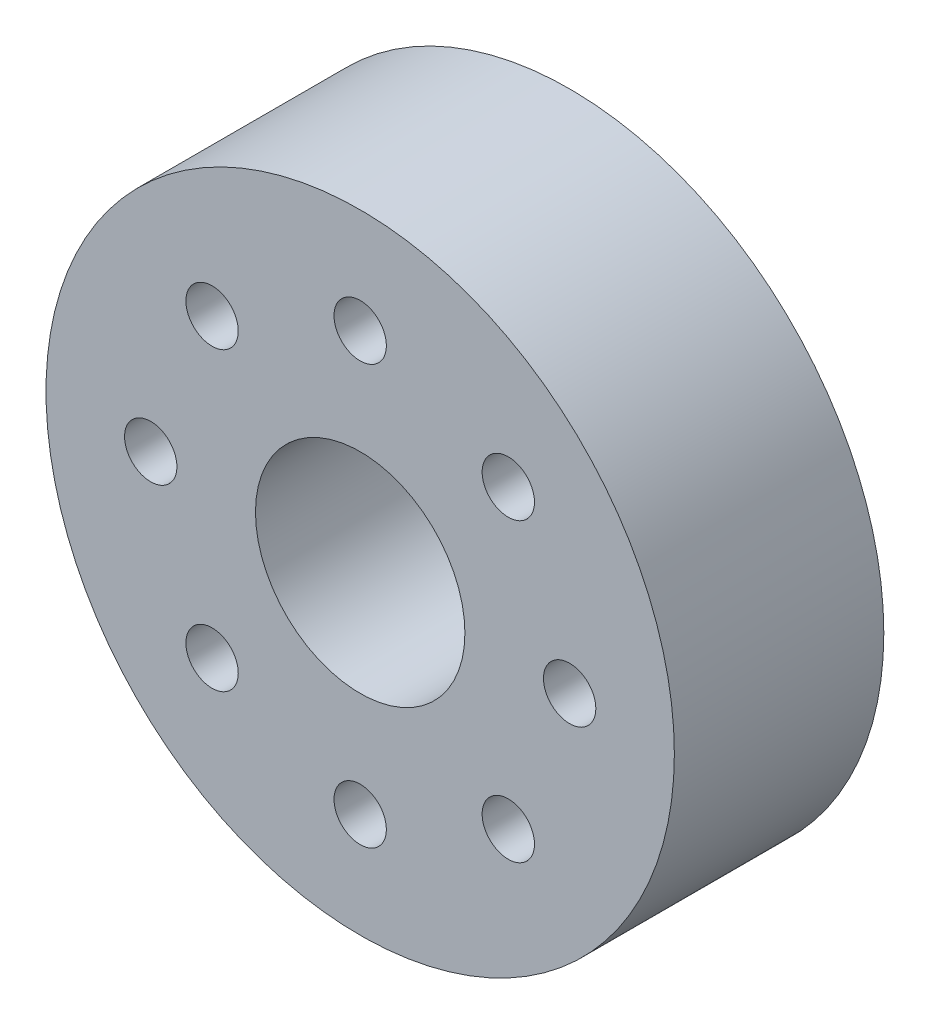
from build123d import *

# Parameters (mm, degrees)
SKETCH1_R           = 12
SKETCH1_R_2         = 4
BOSS_EXTRUDE1_DEPTH = 8
SKETCH2_R           = 1
CUT_EXTRUDE1_DEPTH  = 19.761663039


with BuildPart() as part:
    # Sketch1 → Boss-Extrude1 (new body)
    with BuildSketch(Plane.XY):
        Circle(SKETCH1_R)
        Circle(SKETCH1_R_2, mode=Mode.SUBTRACT)
    extrude(amount=BOSS_EXTRUDE1_DEPTH)

    # Sketch2 → Cut-Extrude1 (cut, through all)
    with BuildSketch(Plane.XY.offset(8)):
        with Locations((-5.656854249, 5.656854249)):
            Circle(SKETCH2_R)
        with BuildLine():
            ThreePointArc((0, 9), (-1, 8), (0, 7))
            Line((0, 7), (0, 9))
        make_face()
        with BuildLine():
            Line((0, 9), (0, 7))
            ThreePointArc((0, 7), (0.707106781, 7.292893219), (1, 8))
            ThreePointArc((1, 8), (0.707106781, 8.707106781), (0, 9))
        make_face()
        with Locations((-8, 0)):
            Circle(SKETCH2_R)
        with Locations((-5.656854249, -5.656854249)):
            Circle(SKETCH2_R)
        with Locations((0, -8)):
            Circle(SKETCH2_R)
        with Locations((5.656854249, -5.656854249)):
            Circle(SKETCH2_R)
        with Locations((8, 0)):
            Circle(SKETCH2_R)
        with Locations((5.656854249, 5.656854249)):
            Circle(SKETCH2_R)
        with BuildLine():
            ThreePointArc((0, 9), (-1, 8), (0, 7))
            Line((0, 7), (0, 9))
        make_face()
        with BuildLine():
            Line((0, 9), (0, 7))
            ThreePointArc((0, 7), (0.707106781, 7.292893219), (1, 8))
            ThreePointArc((1, 8), (0.707106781, 8.707106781), (0, 9))
        make_face()
    extrude(amount=-CUT_EXTRUDE1_DEPTH, mode=Mode.SUBTRACT)


solid = part.part
